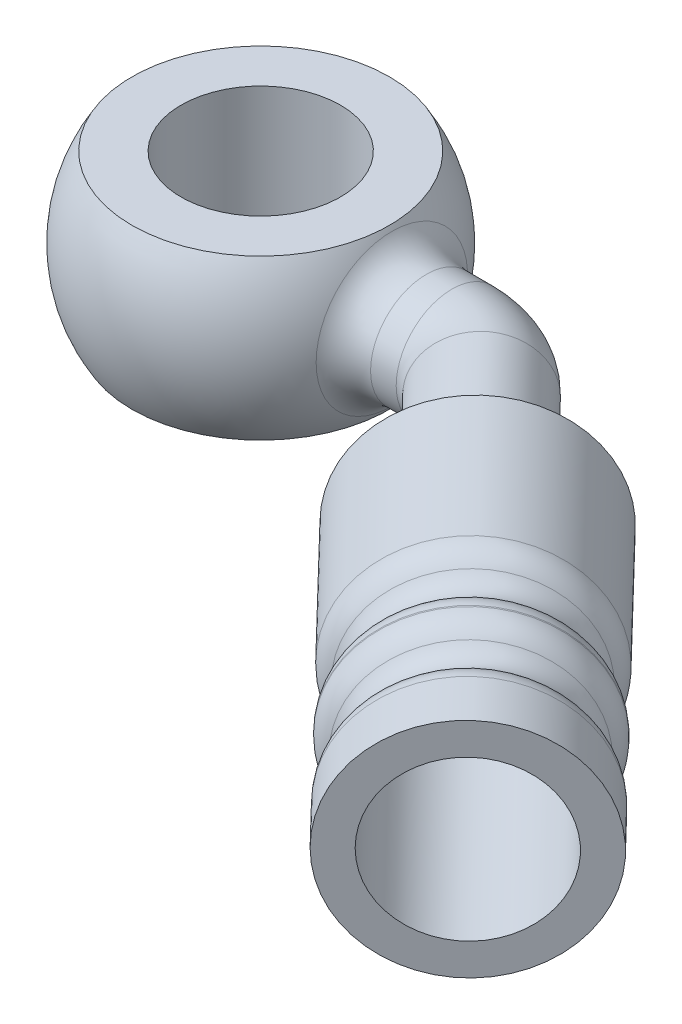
ISO-10303-21;
HEADER;
FILE_DESCRIPTION(('STEP AP214'),'2;1');
FILE_NAME('part.step','',(''),(''),'','','');
FILE_SCHEMA(('AUTOMOTIVE_DESIGN { 1 0 10303 214 1 1 1 1 }'));
ENDSEC;
DATA;
#1=APPLICATION_CONTEXT('core data for automotive mechanical design processes');
#2=APPLICATION_PROTOCOL_DEFINITION('international standard','automotive_design',2000,#1);
#3=PRODUCT_CONTEXT('',#1,'mechanical');
#4=PRODUCT('Part','Part','',(#3));
#5=PRODUCT_RELATED_PRODUCT_CATEGORY('part','',(#4));
#6=PRODUCT_DEFINITION_FORMATION('','',#4);
#7=PRODUCT_DEFINITION_CONTEXT('part definition',#1,'design');
#8=PRODUCT_DEFINITION('design','',#6,#7);
#9=PRODUCT_DEFINITION_SHAPE('','',#8);
#10=(LENGTH_UNIT() NAMED_UNIT(*) SI_UNIT(.MILLI.,.METRE.));
#11=(NAMED_UNIT(*) PLANE_ANGLE_UNIT() SI_UNIT($,.RADIAN.));
#12=(NAMED_UNIT(*) SI_UNIT($,.STERADIAN.) SOLID_ANGLE_UNIT());
#13=UNCERTAINTY_MEASURE_WITH_UNIT(LENGTH_MEASURE(1.E-05),#10,'distance_accuracy_value','');
#14=(GEOMETRIC_REPRESENTATION_CONTEXT(3) GLOBAL_UNCERTAINTY_ASSIGNED_CONTEXT((#13)) GLOBAL_UNIT_ASSIGNED_CONTEXT((#10,
#11,#12)) REPRESENTATION_CONTEXT('',''));
#15=CARTESIAN_POINT('',(0.,0.,0.));
#16=DIRECTION('',(0.,0.,1.));
#17=DIRECTION('',(1.,0.,0.));
#18=AXIS2_PLACEMENT_3D('',#15,#16,#17);
#19=CARTESIAN_POINT('',(15.2226232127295,0.,1.36792239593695));
#20=DIRECTION('',(0.694658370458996,0.,0.719339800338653));
#21=DIRECTION('',(0.719339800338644,0.,-0.694658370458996));
#22=AXIS2_PLACEMENT_3D('',#19,#20,#21);
#23=CYLINDRICAL_SURFACE('',#22,3.5);
#24=CARTESIAN_POINT('',(20.3287453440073,0.,6.65546664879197));
#25=DIRECTION('',(0.694658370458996,0.,0.719339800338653));
#26=DIRECTION('',(0.719339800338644,0.,-0.694658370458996));
#27=AXIS2_PLACEMENT_3D('',#24,#25,#26);
#28=CIRCLE('',#27,3.5);
#29=CARTESIAN_POINT('',(22.8464346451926,0.,4.22416235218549));
#30=VERTEX_POINT('',#29);
#31=EDGE_CURVE('E55',#30,#30,#28,.F.);
#32=ORIENTED_EDGE('',*,*,#31,.T.);
#33=EDGE_LOOP('',(#32));
#34=FACE_BOUND('',#33,.T.);
#35=CARTESIAN_POINT('',(15.2226232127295,0.,1.36792239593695));
#36=DIRECTION('',(0.694658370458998,0.,0.719339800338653));
#37=DIRECTION('',(0.719339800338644,0.,-0.694658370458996));
#38=AXIS2_PLACEMENT_3D('',#35,#36,#37);
#39=CIRCLE('',#38,3.5);
#40=CARTESIAN_POINT('',(17.7403125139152,0.,-1.06338190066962));
#41=VERTEX_POINT('',#40);
#42=EDGE_CURVE('E152',#41,#41,#39,.T.);
#43=ORIENTED_EDGE('',*,*,#42,.T.);
#44=EDGE_LOOP('',(#43));
#45=FACE_BOUND('',#44,.T.);
#46=ADVANCED_FACE('F20',(#34,#45),#23,.T.);
#47=CARTESIAN_POINT('',(1.07552855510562E-13,-50.0000000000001,6.36643515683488E-13));
#48=DIRECTION('',(0.,-1.00000000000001,0.));
#49=DIRECTION('',(0.,0.,-1.));
#50=AXIS2_PLACEMENT_3D('',#47,#48,#49);
#51=CYLINDRICAL_SURFACE('',#50,5.);
#52=CARTESIAN_POINT('',(0.,5.,1.09721259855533E-13));
#53=DIRECTION('',(0.,-1.00000000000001,0.));
#54=DIRECTION('',(0.,0.,-1.));
#55=AXIS2_PLACEMENT_3D('',#52,#53,#54);
#56=CIRCLE('',#55,5.);
#57=CARTESIAN_POINT('',(0.,4.99999999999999,-4.9999999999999));
#58=VERTEX_POINT('',#57);
#59=EDGE_CURVE('E146',#58,#58,#56,.T.);
#60=ORIENTED_EDGE('',*,*,#59,.F.);
#61=EDGE_LOOP('',(#60));
#62=FACE_BOUND('',#61,.T.);
#63=CARTESIAN_POINT('',(0.,-4.99999999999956,1.09287578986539E-13));
#64=DIRECTION('',(0.,-1.00000000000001,0.));
#65=DIRECTION('',(0.,0.,-1.));
#66=AXIS2_PLACEMENT_3D('',#63,#64,#65);
#67=CIRCLE('',#66,5.);
#68=CARTESIAN_POINT('',(0.,-4.99999999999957,-4.99999999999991));
#69=VERTEX_POINT('',#68);
#70=EDGE_CURVE('E138',#69,#69,#67,.T.);
#71=ORIENTED_EDGE('',*,*,#70,.T.);
#72=EDGE_LOOP('',(#71));
#73=FACE_BOUND('',#72,.T.);
#74=CARTESIAN_POINT('',(4.89897948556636,0.,1.00000000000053));
#75=CARTESIAN_POINT('',(4.89898059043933,-0.0555643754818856,0.999997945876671));
#76=CARTESIAN_POINT('',(4.89993508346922,-0.111154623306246,0.99535317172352));
#77=CARTESIAN_POINT('',(4.90364431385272,-0.220762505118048,0.976912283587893));
#78=CARTESIAN_POINT('',(4.90640049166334,-0.274778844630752,0.963108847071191));
#79=CARTESIAN_POINT('',(4.91338873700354,-0.379637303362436,0.926795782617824));
#80=CARTESIAN_POINT('',(4.91761933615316,-0.430482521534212,0.904294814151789));
#81=CARTESIAN_POINT('',(4.92707799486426,-0.527674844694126,0.851249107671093));
#82=CARTESIAN_POINT('',(4.93230599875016,-0.574022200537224,0.820704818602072));
#83=CARTESIAN_POINT('',(4.94325299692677,-0.661561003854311,0.751979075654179));
#84=CARTESIAN_POINT('',(4.94897737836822,-0.702679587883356,0.713705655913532));
#85=CARTESIAN_POINT('',(4.96022472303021,-0.777957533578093,0.630806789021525));
#86=CARTESIAN_POINT('',(4.96574767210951,-0.812116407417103,0.586180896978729));
#87=CARTESIAN_POINT('',(4.97602796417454,-0.872788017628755,0.491361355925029));
#88=CARTESIAN_POINT('',(4.98077821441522,-0.89923151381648,0.441122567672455));
#89=CARTESIAN_POINT('',(4.98891736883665,-0.94327493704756,0.3368041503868));
#90=CARTESIAN_POINT('',(4.99230640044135,-0.960875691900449,0.282724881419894));
#91=CARTESIAN_POINT('',(4.99730320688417,-0.986507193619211,0.173016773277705));
#92=CARTESIAN_POINT('',(4.99893386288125,-0.994660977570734,0.117417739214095));
#93=CARTESIAN_POINT('',(5.00030921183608,-1.00155095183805,0.00561856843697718));
#94=CARTESIAN_POINT('',(5.00005408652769,-1.00028804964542,-0.0505815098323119));
#95=CARTESIAN_POINT('',(4.99770434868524,-0.988473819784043,-0.161142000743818));
#96=CARTESIAN_POINT('',(4.99563598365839,-0.978055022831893,-0.215517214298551));
#97=CARTESIAN_POINT('',(4.98992177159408,-0.94843496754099,-0.32173162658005));
#98=CARTESIAN_POINT('',(4.98627586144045,-0.929233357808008,-0.373570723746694));
#99=CARTESIAN_POINT('',(4.97777296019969,-0.882469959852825,-0.473619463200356));
#100=CARTESIAN_POINT('',(4.97290848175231,-0.854856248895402,-0.52180417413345));
#101=CARTESIAN_POINT('',(4.96250469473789,-0.792090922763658,-0.612905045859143));
#102=CARTESIAN_POINT('',(4.95696530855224,-0.75693844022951,-0.655820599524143));
#103=CARTESIAN_POINT('',(4.9457096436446,-0.679366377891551,-0.735951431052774));
#104=CARTESIAN_POINT('',(4.93999196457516,-0.636830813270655,-0.773054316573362));
#105=CARTESIAN_POINT('',(4.92911571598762,-0.546083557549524,-0.839618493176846));
#106=CARTESIAN_POINT('',(4.92395715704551,-0.497871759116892,-0.869079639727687));
#107=CARTESIAN_POINT('',(4.91478047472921,-0.396979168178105,-0.919562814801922));
#108=CARTESIAN_POINT('',(4.91076481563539,-0.344289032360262,-0.940566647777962));
#109=CARTESIAN_POINT('',(4.90436476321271,-0.236028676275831,-0.973390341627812));
#110=CARTESIAN_POINT('',(4.90198015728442,-0.180458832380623,-0.985211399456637));
#111=CARTESIAN_POINT('',(4.8991547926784,-0.0690351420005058,-0.999166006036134));
#112=CARTESIAN_POINT('',(4.89868147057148,-0.013202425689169,-1.00146185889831));
#113=CARTESIAN_POINT('',(4.89964485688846,0.0980482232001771,-0.996737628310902));
#114=CARTESIAN_POINT('',(4.90108145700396,0.153466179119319,-0.989718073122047));
#115=CARTESIAN_POINT('',(4.90567232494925,0.261768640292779,-0.966702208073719));
#116=CARTESIAN_POINT('',(4.90880999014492,0.314672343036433,-0.95079262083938));
#117=CARTESIAN_POINT('',(4.9164348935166,0.417063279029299,-0.910541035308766));
#118=CARTESIAN_POINT('',(4.9209222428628,0.46655023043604,-0.886198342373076));
#119=CARTESIAN_POINT('',(4.93081405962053,0.561413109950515,-0.829404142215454));
#120=CARTESIAN_POINT('',(4.93622971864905,0.606727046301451,-0.796851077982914));
#121=CARTESIAN_POINT('',(4.94733723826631,0.691308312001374,-0.72469557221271));
#122=CARTESIAN_POINT('',(4.95302912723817,0.730575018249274,-0.685092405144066));
#123=CARTESIAN_POINT('',(4.96415345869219,0.802562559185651,-0.599232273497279));
#124=CARTESIAN_POINT('',(4.96958057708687,0.835173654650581,-0.552882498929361));
#125=CARTESIAN_POINT('',(4.97947127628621,0.892145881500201,-0.45526789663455));
#126=CARTESIAN_POINT('',(4.98393489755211,0.916507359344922,-0.404003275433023));
#127=CARTESIAN_POINT('',(4.99137294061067,0.956128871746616,-0.298302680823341));
#128=CARTESIAN_POINT('',(4.99435579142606,0.971440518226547,-0.243886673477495));
#129=CARTESIAN_POINT('',(4.99853235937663,0.992691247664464,-0.133189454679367));
#130=CARTESIAN_POINT('',(4.99972629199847,0.998631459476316,-0.0769084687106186));
#131=CARTESIAN_POINT('',(5.00018540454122,1.00092698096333,0.0348728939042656));
#132=CARTESIAN_POINT('',(4.9994837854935,0.997447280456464,0.0903698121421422));
#133=CARTESIAN_POINT('',(4.99630043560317,0.981366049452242,0.199971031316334));
#134=CARTESIAN_POINT('',(4.99381872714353,0.968764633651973,0.254075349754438));
#135=CARTESIAN_POINT('',(4.98735498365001,0.934871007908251,0.359252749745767));
#136=CARTESIAN_POINT('',(4.98337637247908,0.91359862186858,0.410332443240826));
#137=CARTESIAN_POINT('',(4.9743472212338,0.862987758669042,0.508221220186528));
#138=CARTESIAN_POINT('',(4.96929659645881,0.833648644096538,0.555029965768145));
#139=CARTESIAN_POINT('',(4.95857599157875,0.767180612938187,0.643863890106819));
#140=CARTESIAN_POINT('',(4.95289733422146,0.729933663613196,0.685799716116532));
#141=CARTESIAN_POINT('',(4.94161222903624,0.648949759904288,0.762882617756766));
#142=CARTESIAN_POINT('',(4.93600579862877,0.605211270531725,0.798028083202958));
#143=CARTESIAN_POINT('',(4.92543342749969,0.51192068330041,0.860892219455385));
#144=CARTESIAN_POINT('',(4.92047503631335,0.462311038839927,0.888526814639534));
#145=CARTESIAN_POINT('',(4.91185237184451,0.359067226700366,0.935024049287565));
#146=CARTESIAN_POINT('',(4.9081869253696,0.305436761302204,0.95389464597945));
#147=CARTESIAN_POINT('',(4.90329681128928,0.209737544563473,0.978669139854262));
#148=CARTESIAN_POINT('',(4.9016878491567,0.168214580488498,0.986653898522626));
#149=CARTESIAN_POINT('',(4.89952878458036,0.0844660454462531,0.997320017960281));
#150=CARTESIAN_POINT('',(4.89897864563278,0.042240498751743,1.00000156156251));
#151=CARTESIAN_POINT('',(4.89897948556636,0.,1.00000000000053));
#152=B_SPLINE_CURVE_WITH_KNOTS('',3,(#74,#75,#76,#77,#78,#79,#80,#81,#82,#83,#84,#85,#86,#87,
#88,#89,#90,#91,#92,#93,#94,#95,#96,#97,#98,#99,#100,#101,#102,#103,#104,#105,#106,#107,#108,
#109,#110,#111,#112,#113,#114,#115,#116,#117,#118,#119,#120,#121,#122,#123,#124,#125,#126,#127,
#128,#129,#130,#131,#132,#133,#134,#135,#136,#137,#138,#139,#140,#141,#142,#143,#144,#145,#146,
#147,#148,#149,#150,#151),.UNSPECIFIED.,.T.,.F.,(4,2,2,2,2,2,2,2,2,2,2,2,2,2,2,2,2,2,2,2,2,2,2,
2,2,2,2,2,2,2,2,2,2,2,2,2,2,2,4),(0.,0.166538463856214,0.333210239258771,0.499716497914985,
0.666213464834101,0.834822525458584,1.00344340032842,1.17353400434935,1.34360868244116,
1.51144248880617,1.67926012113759,1.84468789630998,2.0101222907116,2.17659924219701,
2.34309535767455,2.51249346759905,2.6818947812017,2.85165863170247,3.02140035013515,
3.18823757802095,3.35506534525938,3.52029341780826,3.6855351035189,3.85293059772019,
4.02034332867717,4.19032601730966,4.36030156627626,4.52929813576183,4.69827434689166,
4.8643101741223,5.03034391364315,5.19600017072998,5.36166952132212,5.53001152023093,
5.69839338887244,5.86858898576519,6.03862975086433,6.16523803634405,6.29184195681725),.UNSPECIFIED.);
#153=CARTESIAN_POINT('',(4.89897948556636,0.,1.00000000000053));
#154=VERTEX_POINT('',#153);
#155=EDGE_CURVE('E65',#154,#154,#152,.T.);
#156=ORIENTED_EDGE('',*,*,#155,.T.);
#157=EDGE_LOOP('',(#156));
#158=FACE_BOUND('',#157,.T.);
#159=ADVANCED_FACE('F22',(#62,#73,#158),#51,.F.);
#160=CARTESIAN_POINT('',(0.,4.02455846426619E-13,6.93889390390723E-13));
#161=DIRECTION('',(0.,-1.00000000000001,0.));
#162=DIRECTION('',(0.999999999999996,0.,0.));
#163=AXIS2_PLACEMENT_3D('',#160,#161,#162);
#164=SPHERICAL_SURFACE('',#163,9.5);
#165=CARTESIAN_POINT('',(8.22724133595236,0.,-8.31799906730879E-13));
#166=DIRECTION('',(-0.999999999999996,0.,0.));
#167=DIRECTION('',(0.,0.,1.));
#168=AXIS2_PLACEMENT_3D('',#165,#166,#167);
#169=CIRCLE('',#168,4.75);
#170=CARTESIAN_POINT('',(8.2272413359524,0.,4.74999999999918));
#171=VERTEX_POINT('',#170);
#172=EDGE_CURVE('E61',#171,#171,#169,.T.);
#173=ORIENTED_EDGE('',*,*,#172,.T.);
#174=EDGE_LOOP('',(#173));
#175=FACE_BOUND('',#174,.T.);
#176=CARTESIAN_POINT('',(0.,-4.99999999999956,1.09287578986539E-13));
#177=DIRECTION('',(0.,-1.00000000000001,0.));
#178=DIRECTION('',(0.,0.,-1.));
#179=AXIS2_PLACEMENT_3D('',#176,#177,#178);
#180=CIRCLE('',#179,8.07774721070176);
#181=CARTESIAN_POINT('',(0.,-4.99999999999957,-8.07774721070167));
#182=VERTEX_POINT('',#181);
#183=EDGE_CURVE('E135',#182,#182,#180,.T.);
#184=ORIENTED_EDGE('',*,*,#183,.F.);
#185=EDGE_LOOP('',(#184));
#186=FACE_BOUND('',#185,.T.);
#187=CARTESIAN_POINT('',(0.,5.,1.09721259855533E-13));
#188=DIRECTION('',(0.,-1.00000000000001,0.));
#189=DIRECTION('',(0.,0.,-1.));
#190=AXIS2_PLACEMENT_3D('',#187,#188,#189);
#191=CIRCLE('',#190,8.07774721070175);
#192=CARTESIAN_POINT('',(0.,4.99999999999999,-8.07774721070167));
#193=VERTEX_POINT('',#192);
#194=EDGE_CURVE('E141',#193,#193,#191,.T.);
#195=ORIENTED_EDGE('',*,*,#194,.T.);
#196=EDGE_LOOP('',(#195));
#197=FACE_BOUND('',#196,.T.);
#198=CARTESIAN_POINT('',(-8.36660026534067,0.,4.13297868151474E-13));
#199=DIRECTION('',(0.999999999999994,0.,0.));
#200=DIRECTION('',(0.,1.00000000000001,0.));
#201=AXIS2_PLACEMENT_3D('',#198,#199,#200);
#202=CIRCLE('',#201,4.5);
#203=CARTESIAN_POINT('',(-8.36660026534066,4.50000000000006,4.11642941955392E-13));
#204=VERTEX_POINT('',#203);
#205=EDGE_CURVE('E64',#204,#204,#202,.F.);
#206=ORIENTED_EDGE('',*,*,#205,.F.);
#207=EDGE_LOOP('',(#206));
#208=FACE_BOUND('',#207,.T.);
#209=ADVANCED_FACE('F105',(#175,#186,#197,#208),#164,.T.);
#210=CARTESIAN_POINT('',(5.00000000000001,-4.99999999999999,0.));
#211=DIRECTION('',(0.,-1.00000000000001,0.));
#212=DIRECTION('',(0.,0.,-1.));
#213=AXIS2_PLACEMENT_3D('',#210,#211,#212);
#214=PLANE('',#213);
#215=ORIENTED_EDGE('',*,*,#183,.T.);
#216=EDGE_LOOP('',(#215));
#217=FACE_BOUND('',#216,.T.);
#218=ORIENTED_EDGE('',*,*,#70,.F.);
#219=EDGE_LOOP('',(#218));
#220=FACE_BOUND('',#219,.T.);
#221=ADVANCED_FACE('F124',(#217,#220),#214,.T.);
#222=CARTESIAN_POINT('',(5.00000000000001,5.,1.95156391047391E-13));
#223=DIRECTION('',(0.,1.00000000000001,0.));
#224=DIRECTION('',(0.,0.,1.));
#225=AXIS2_PLACEMENT_3D('',#222,#223,#224);
#226=PLANE('',#225);
#227=ORIENTED_EDGE('',*,*,#59,.T.);
#228=EDGE_LOOP('',(#227));
#229=FACE_BOUND('',#228,.T.);
#230=ORIENTED_EDGE('',*,*,#194,.F.);
#231=EDGE_LOOP('',(#230));
#232=FACE_BOUND('',#231,.T.);
#233=ADVANCED_FACE('F120',(#229,#232),#226,.T.);
#234=CARTESIAN_POINT('',(-8.36660026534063,4.50000000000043,-9.50000000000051));
#235=DIRECTION('',(0.999999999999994,0.,0.));
#236=DIRECTION('',(0.,1.00000000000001,0.));
#237=AXIS2_PLACEMENT_3D('',#234,#235,#236);
#238=PLANE('',#237);
#239=ORIENTED_EDGE('',*,*,#205,.T.);
#240=EDGE_LOOP('',(#239));
#241=FACE_BOUND('',#240,.T.);
#242=ADVANCED_FACE('F117',(#241),#238,.F.);
#243=CARTESIAN_POINT('',(28.9081593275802,1.59594559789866E-13,15.5397099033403));
#244=DIRECTION('',(0.694658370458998,0.,0.719339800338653));
#245=DIRECTION('',(0.719339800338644,0.,-0.694658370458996));
#246=AXIS2_PLACEMENT_3D('',#243,#244,#245);
#247=PLANE('',#246);
#248=CARTESIAN_POINT('',(28.9081593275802,1.59594559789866E-13,15.5397099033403));
#249=DIRECTION('',(0.694658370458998,0.,0.719339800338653));
#250=DIRECTION('',(0.719339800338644,0.,-0.694658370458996));
#251=AXIS2_PLACEMENT_3D('',#248,#249,#250);
#252=CIRCLE('',#251,1.);
#253=CARTESIAN_POINT('',(29.6274991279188,1.57533708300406E-13,14.8450515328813));
#254=VERTEX_POINT('',#253);
#255=EDGE_CURVE('E72',#254,#254,#252,.T.);
#256=ORIENTED_EDGE('',*,*,#255,.F.);
#257=EDGE_LOOP('',(#256));
#258=FACE_BOUND('',#257,.T.);
#259=CARTESIAN_POINT('',(28.9081593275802,1.59594559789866E-13,15.5397099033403));
#260=DIRECTION('',(-0.694658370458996,0.,-0.719339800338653));
#261=DIRECTION('',(-0.719339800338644,0.,0.694658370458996));
#262=AXIS2_PLACEMENT_3D('',#259,#260,#261);
#263=CIRCLE('',#262,4.99999999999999);
#264=CARTESIAN_POINT('',(25.311460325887,1.69309011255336E-13,19.0130017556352));
#265=VERTEX_POINT('',#264);
#266=EDGE_CURVE('E73',#265,#265,#263,.T.);
#267=ORIENTED_EDGE('',*,*,#266,.F.);
#268=EDGE_LOOP('',(#267));
#269=FACE_BOUND('',#268,.T.);
#270=ADVANCED_FACE('F109',(#258,#269),#247,.T.);
#271=CARTESIAN_POINT('',(12.,0.,4.47997345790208));
#272=DIRECTION('',(0.,1.00000000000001,0.));
#273=DIRECTION('',(0.,0.,1.));
#274=AXIS2_PLACEMENT_3D('',#271,#272,#273);
#275=TOROIDAL_SURFACE('',#274,4.47997345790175,3.5);
#276=CARTESIAN_POINT('',(12.0000000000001,2.84494650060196E-13,-2.75821032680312E-13));
#277=DIRECTION('',(0.999999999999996,0.,0.));
#278=DIRECTION('',(0.,0.,-1.));
#279=AXIS2_PLACEMENT_3D('',#276,#277,#278);
#280=CIRCLE('',#279,3.5);
#281=CARTESIAN_POINT('',(12.0000000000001,4.52546982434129E-13,-3.49999999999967));
#282=VERTEX_POINT('',#281);
#283=EDGE_CURVE('E149',#282,#282,#280,.T.);
#284=CARTESIAN_POINT('',(12.,0.,4.47997345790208));
#285=DIRECTION('',(0.,1.00000000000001,0.));
#286=DIRECTION('',(0.,0.,1.));
#287=AXIS2_PLACEMENT_3D('',#284,#285,#286);
#288=CIRCLE('',#287,7.97997345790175);
#289=EDGE_CURVE('',#41,#282,#288,.T.);
#290=ORIENTED_EDGE('',*,*,#42,.F.);
#291=ORIENTED_EDGE('',*,*,#283,.T.);
#292=ORIENTED_EDGE('',*,*,#289,.T.);
#293=ORIENTED_EDGE('',*,*,#289,.F.);
#294=EDGE_LOOP('',(#290,#292,#291,#293));
#295=FACE_BOUND('',#294,.T.);
#296=ADVANCED_FACE('F110',(#295),#275,.T.);
#297=CARTESIAN_POINT('',(12.0000000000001,2.84494650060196E-13,-2.75821032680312E-13));
#298=DIRECTION('',(-0.999999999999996,0.,0.));
#299=DIRECTION('',(0.,0.,1.));
#300=AXIS2_PLACEMENT_3D('',#297,#298,#299);
#301=CYLINDRICAL_SURFACE('',#300,3.5);
#302=CARTESIAN_POINT('',(10.3923048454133,4.37150315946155E-13,7.23379689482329E-13));
#303=DIRECTION('',(-0.999999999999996,0.,0.));
#304=DIRECTION('',(0.,0.,1.));
#305=AXIS2_PLACEMENT_3D('',#302,#303,#304);
#306=CIRCLE('',#305,3.5);
#307=CARTESIAN_POINT('',(10.3923048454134,4.41546105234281E-13,3.50000000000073));
#308=VERTEX_POINT('',#307);
#309=EDGE_CURVE('E58',#308,#308,#306,.F.);
#310=ORIENTED_EDGE('',*,*,#309,.T.);
#311=EDGE_LOOP('',(#310));
#312=FACE_BOUND('',#311,.T.);
#313=ORIENTED_EDGE('',*,*,#283,.F.);
#314=EDGE_LOOP('',(#313));
#315=FACE_BOUND('',#314,.T.);
#316=ADVANCED_FACE('F93',(#312,#315),#301,.T.);
#317=CARTESIAN_POINT('',(12.0000000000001,2.84494650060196E-13,-2.75821032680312E-13));
#318=DIRECTION('',(-0.999999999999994,0.,0.));
#319=DIRECTION('',(0.,0.,1.));
#320=AXIS2_PLACEMENT_3D('',#317,#318,#319);
#321=CYLINDRICAL_SURFACE('',#320,1.);
#322=ORIENTED_EDGE('',*,*,#155,.F.);
#323=EDGE_LOOP('',(#322));
#324=FACE_BOUND('',#323,.T.);
#325=CARTESIAN_POINT('',(12.0000000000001,2.84494650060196E-13,-2.75821032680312E-13));
#326=DIRECTION('',(0.999999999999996,0.,0.));
#327=DIRECTION('',(0.,0.,-1.));
#328=AXIS2_PLACEMENT_3D('',#325,#326,#327);
#329=CIRCLE('',#328,1.);
#330=CARTESIAN_POINT('',(12.0000000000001,3.32509602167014E-13,-0.999999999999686));
#331=VERTEX_POINT('',#330);
#332=EDGE_CURVE('E155',#331,#331,#329,.T.);
#333=ORIENTED_EDGE('',*,*,#332,.T.);
#334=EDGE_LOOP('',(#333));
#335=FACE_BOUND('',#334,.T.);
#336=ADVANCED_FACE('F75',(#324,#335),#321,.F.);
#337=CARTESIAN_POINT('',(12.,0.,4.47997345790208));
#338=DIRECTION('',(0.,1.00000000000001,0.));
#339=DIRECTION('',(0.,0.,1.));
#340=AXIS2_PLACEMENT_3D('',#337,#338,#339);
#341=TOROIDAL_SURFACE('',#340,4.47997345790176,1.);
#342=CARTESIAN_POINT('',(15.2226232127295,0.,1.367922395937));
#343=DIRECTION('',(0.694658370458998,0.,0.719339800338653));
#344=DIRECTION('',(0.719339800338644,0.,-0.694658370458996));
#345=AXIS2_PLACEMENT_3D('',#342,#343,#344);
#346=CIRCLE('',#345,1.);
#347=CARTESIAN_POINT('',(15.9419630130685,0.,0.673264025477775));
#348=VERTEX_POINT('',#347);
#349=EDGE_CURVE('E158',#348,#348,#346,.T.);
#350=CARTESIAN_POINT('',(12.,0.,4.47997345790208));
#351=DIRECTION('',(0.,1.00000000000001,0.));
#352=DIRECTION('',(0.,0.,1.));
#353=AXIS2_PLACEMENT_3D('',#350,#351,#352);
#354=CIRCLE('',#353,5.47997345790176);
#355=EDGE_CURVE('',#348,#331,#354,.T.);
#356=ORIENTED_EDGE('',*,*,#349,.T.);
#357=ORIENTED_EDGE('',*,*,#332,.F.);
#358=ORIENTED_EDGE('',*,*,#355,.T.);
#359=ORIENTED_EDGE('',*,*,#355,.F.);
#360=EDGE_LOOP('',(#356,#358,#357,#359));
#361=FACE_BOUND('',#360,.T.);
#362=ADVANCED_FACE('F86',(#361),#341,.F.);
#363=CARTESIAN_POINT('',(15.2226232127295,0.,1.367922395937));
#364=DIRECTION('',(0.694658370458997,0.,0.719339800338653));
#365=DIRECTION('',(0.719339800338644,0.,-0.694658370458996));
#366=AXIS2_PLACEMENT_3D('',#363,#364,#365);
#367=CYLINDRICAL_SURFACE('',#366,1.);
#368=ORIENTED_EDGE('',*,*,#349,.F.);
#369=EDGE_LOOP('',(#368));
#370=FACE_BOUND('',#369,.T.);
#371=ORIENTED_EDGE('',*,*,#255,.T.);
#372=EDGE_LOOP('',(#371));
#373=FACE_BOUND('',#372,.T.);
#374=ADVANCED_FACE('F84',(#370,#373),#367,.F.);
#375=CARTESIAN_POINT('',(10.3923048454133,4.37150315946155E-13,7.23379689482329E-13));
#376=DIRECTION('',(-0.999999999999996,0.,0.));
#377=DIRECTION('',(0.,0.,1.));
#378=AXIS2_PLACEMENT_3D('',#375,#376,#377);
#379=TOROIDAL_SURFACE('',#378,6.,2.5);
#380=ORIENTED_EDGE('',*,*,#309,.F.);
#381=EDGE_LOOP('',(#380));
#382=FACE_BOUND('',#381,.T.);
#383=ORIENTED_EDGE('',*,*,#172,.F.);
#384=EDGE_LOOP('',(#383));
#385=FACE_BOUND('',#384,.T.);
#386=ADVANCED_FACE('F82',(#382,#385),#379,.F.);
#387=CARTESIAN_POINT('',(28.9081593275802,1.59594559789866E-13,15.5397099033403));
#388=DIRECTION('',(-0.694658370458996,0.,-0.719339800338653));
#389=DIRECTION('',(-0.719339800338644,0.,0.694658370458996));
#390=AXIS2_PLACEMENT_3D('',#387,#388,#389);
#391=CYLINDRICAL_SURFACE('',#390,4.99999999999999);
#392=CARTESIAN_POINT('',(39.4318505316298,3.05311331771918E-13,26.4373111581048));
#393=DIRECTION('',(-0.694658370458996,0.,-0.719339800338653));
#394=DIRECTION('',(-0.719339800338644,0.,0.694658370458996));
#395=AXIS2_PLACEMENT_3D('',#392,#393,#394);
#396=CIRCLE('',#395,4.99999999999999);
#397=CARTESIAN_POINT('',(35.8351515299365,1.74722712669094E-13,29.9106030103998));
#398=VERTEX_POINT('',#397);
#399=EDGE_CURVE('E164',#398,#398,#396,.T.);
#400=CARTESIAN_POINT('',(35.8351515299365,1.74722712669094E-13,29.9106030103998));
#401=CARTESIAN_POINT('',(35.725529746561,1.74666319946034E-13,29.7970863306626));
#402=CARTESIAN_POINT('',(35.6159079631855,1.74609927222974E-13,29.6835696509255));
#403=CARTESIAN_POINT('',(35.3966643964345,1.74497141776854E-13,29.4565362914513));
#404=CARTESIAN_POINT('',(35.2870426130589,1.74440749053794E-13,29.3430196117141));
#405=CARTESIAN_POINT('',(35.0677990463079,1.74327963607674E-13,29.1159862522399));
#406=CARTESIAN_POINT('',(34.9581772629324,1.74271570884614E-13,29.0024695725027));
#407=CARTESIAN_POINT('',(34.7389336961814,1.74158785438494E-13,28.7754362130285));
#408=CARTESIAN_POINT('',(34.6293119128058,1.74102392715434E-13,28.6619195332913));
#409=CARTESIAN_POINT('',(34.4100683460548,1.73989607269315E-13,28.4348861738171));
#410=CARTESIAN_POINT('',(34.3004465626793,1.73933214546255E-13,28.3213694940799));
#411=CARTESIAN_POINT('',(34.0812029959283,1.73820429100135E-13,28.0943361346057));
#412=CARTESIAN_POINT('',(33.9715812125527,1.73764036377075E-13,27.9808194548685));
#413=CARTESIAN_POINT('',(33.7523376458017,1.73651250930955E-13,27.7537860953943));
#414=CARTESIAN_POINT('',(33.6427158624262,1.73594858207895E-13,27.6402694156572));
#415=CARTESIAN_POINT('',(33.4234722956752,1.73482072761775E-13,27.4132360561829));
#416=CARTESIAN_POINT('',(33.3138505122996,1.73425680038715E-13,27.2997193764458));
#417=CARTESIAN_POINT('',(33.0946069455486,1.73312894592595E-13,27.0726860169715));
#418=CARTESIAN_POINT('',(32.9849851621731,1.73256501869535E-13,26.9591693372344));
#419=CARTESIAN_POINT('',(32.7657415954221,1.73143716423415E-13,26.7321359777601));
#420=CARTESIAN_POINT('',(32.6561198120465,1.73087323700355E-13,26.618619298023));
#421=CARTESIAN_POINT('',(32.4368762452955,1.72974538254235E-13,26.3915859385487));
#422=CARTESIAN_POINT('',(32.32725446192,1.72918145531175E-13,26.2780692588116));
#423=CARTESIAN_POINT('',(32.108010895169,1.72805360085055E-13,26.0510358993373));
#424=CARTESIAN_POINT('',(31.9983891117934,1.72748967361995E-13,25.9375192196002));
#425=CARTESIAN_POINT('',(31.7791455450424,1.72636181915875E-13,25.7104858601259));
#426=CARTESIAN_POINT('',(31.6695237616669,1.72579789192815E-13,25.5969691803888));
#427=CARTESIAN_POINT('',(31.4502801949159,1.72467003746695E-13,25.3699358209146));
#428=CARTESIAN_POINT('',(31.3406584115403,1.72410611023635E-13,25.2564191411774));
#429=CARTESIAN_POINT('',(31.1214148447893,1.72297825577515E-13,25.0293857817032));
#430=CARTESIAN_POINT('',(31.0117930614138,1.72241432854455E-13,24.915869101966));
#431=CARTESIAN_POINT('',(30.7925494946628,1.72128647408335E-13,24.6888357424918));
#432=CARTESIAN_POINT('',(30.6829277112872,1.72072254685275E-13,24.5753190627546));
#433=CARTESIAN_POINT('',(30.4636841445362,1.71959469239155E-13,24.3482857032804));
#434=CARTESIAN_POINT('',(30.3540623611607,1.71903076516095E-13,24.2347690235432));
#435=CARTESIAN_POINT('',(30.1348187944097,1.71790291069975E-13,24.007735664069));
#436=CARTESIAN_POINT('',(30.0251970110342,1.71733898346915E-13,23.8942189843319));
#437=CARTESIAN_POINT('',(29.8059534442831,1.71621112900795E-13,23.6671856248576));
#438=CARTESIAN_POINT('',(29.6963316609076,1.71564720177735E-13,23.5536689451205));
#439=CARTESIAN_POINT('',(29.4770880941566,1.71451934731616E-13,23.3266355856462));
#440=CARTESIAN_POINT('',(29.3674663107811,1.71395542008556E-13,23.2131189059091));
#441=CARTESIAN_POINT('',(29.14822274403,1.71282756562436E-13,22.9860855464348));
#442=CARTESIAN_POINT('',(29.0386009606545,1.71226363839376E-13,22.8725688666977));
#443=CARTESIAN_POINT('',(28.8193573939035,1.71113578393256E-13,22.6455355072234));
#444=CARTESIAN_POINT('',(28.709735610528,1.71057185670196E-13,22.5320188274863));
#445=CARTESIAN_POINT('',(28.4904920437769,1.70944400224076E-13,22.304985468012));
#446=CARTESIAN_POINT('',(28.3808702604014,1.70888007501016E-13,22.1914687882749));
#447=CARTESIAN_POINT('',(28.1616266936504,1.70775222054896E-13,21.9644354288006));
#448=CARTESIAN_POINT('',(28.0520049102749,1.70718829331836E-13,21.8509187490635));
#449=CARTESIAN_POINT('',(27.8327613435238,1.70606043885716E-13,21.6238853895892));
#450=CARTESIAN_POINT('',(27.7231395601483,1.70549651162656E-13,21.5103687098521));
#451=CARTESIAN_POINT('',(27.5038959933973,1.70436865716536E-13,21.2833353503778));
#452=CARTESIAN_POINT('',(27.3942742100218,1.70380472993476E-13,21.1698186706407));
#453=CARTESIAN_POINT('',(27.1750306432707,1.70267687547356E-13,20.9427853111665));
#454=CARTESIAN_POINT('',(27.0654088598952,1.70211294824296E-13,20.8292686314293));
#455=CARTESIAN_POINT('',(26.8461652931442,1.70098509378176E-13,20.6022352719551));
#456=CARTESIAN_POINT('',(26.7365435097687,1.70042116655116E-13,20.4887185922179));
#457=CARTESIAN_POINT('',(26.5172999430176,1.69929331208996E-13,20.2616852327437));
#458=CARTESIAN_POINT('',(26.4076781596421,1.69872938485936E-13,20.1481685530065));
#459=CARTESIAN_POINT('',(26.1884345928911,1.69760153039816E-13,19.9211351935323));
#460=CARTESIAN_POINT('',(26.0788128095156,1.69703760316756E-13,19.8076185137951));
#461=CARTESIAN_POINT('',(25.8595692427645,1.69590974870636E-13,19.5805851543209));
#462=CARTESIAN_POINT('',(25.749947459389,1.69534582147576E-13,19.4670684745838));
#463=CARTESIAN_POINT('',(25.530703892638,1.69421796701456E-13,19.2400351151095));
#464=CARTESIAN_POINT('',(25.4210821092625,1.69365403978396E-13,19.1265184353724));
#465=CARTESIAN_POINT('',(25.311460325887,1.69309011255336E-13,19.0130017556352));
#466=B_SPLINE_CURVE_WITH_KNOTS('',3,(#400,#401,#402,#403,#404,#405,#406,#407,#408,#409,#410,
#411,#412,#413,#414,#415,#416,#417,#418,#419,#420,#421,#422,#423,#424,#425,#426,#427,#428,#429,
#430,#431,#432,#433,#434,#435,#436,#437,#438,#439,#440,#441,#442,#443,#444,#445,#446,#447,#448,
#449,#450,#451,#452,#453,#454,#455,#456,#457,#458,#459,#460,#461,#462,#463,#464,#465),
.UNSPECIFIED.,.F.,.F.,(4,2,2,2,2,2,2,2,2,2,2,2,2,2,2,2,2,2,2,2,2,2,2,2,2,2,2,2,2,2,2,2,4),(0.,
0.473420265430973,0.946840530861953,1.42026079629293,1.89368106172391,2.36710132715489,
2.84052159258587,3.31394185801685,3.78736212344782,4.2607823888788,4.73420265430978,
5.20762291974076,5.68104318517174,6.15446345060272,6.62788371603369,7.10130398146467,
7.57472424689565,8.04814451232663,8.52156477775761,8.99498504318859,9.46840530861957,
9.94182557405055,10.4152458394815,10.8886661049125,11.3620863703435,11.8355066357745,
12.3089269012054,12.7823471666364,13.2557674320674,13.7291876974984,14.2026079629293,
14.6760282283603,15.1494484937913),.UNSPECIFIED.);
#467=EDGE_CURVE('BSEAM204',#398,#265,#466,.T.);
#468=ORIENTED_EDGE('',*,*,#399,.F.);
#469=ORIENTED_EDGE('',*,*,#266,.T.);
#470=ORIENTED_EDGE('',*,*,#467,.T.);
#471=ORIENTED_EDGE('',*,*,#467,.F.);
#472=EDGE_LOOP('',(#468,#470,#469,#471));
#473=FACE_BOUND('',#472,.T.);
#474=ADVANCED_FACE('F204',(#473),#391,.F.);
#475=CARTESIAN_POINT('',(44.4672291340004,5.55111512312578E-13,21.5747025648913));
#476=DIRECTION('',(-0.694658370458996,0.,-0.719339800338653));
#477=DIRECTION('',(-0.719339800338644,0.,0.694658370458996));
#478=AXIS2_PLACEMENT_3D('',#475,#476,#477);
#479=PLANE('',#478);
#480=CARTESIAN_POINT('',(39.4318505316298,3.05311331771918E-13,26.4373111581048));
#481=DIRECTION('',(-0.694658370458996,0.,-0.719339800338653));
#482=DIRECTION('',(-0.719339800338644,0.,0.694658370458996));
#483=AXIS2_PLACEMENT_3D('',#480,#481,#482);
#484=CIRCLE('',#483,7.00000000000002);
#485=CARTESIAN_POINT('',(34.3964719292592,1.78608493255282E-13,31.2999197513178));
#486=VERTEX_POINT('',#485);
#487=EDGE_CURVE('E167',#486,#486,#484,.T.);
#488=ORIENTED_EDGE('',*,*,#487,.F.);
#489=EDGE_LOOP('',(#488));
#490=FACE_BOUND('',#489,.T.);
#491=ORIENTED_EDGE('',*,*,#399,.T.);
#492=EDGE_LOOP('',(#491));
#493=FACE_BOUND('',#492,.T.);
#494=ADVANCED_FACE('F202',(#490,#493),#479,.F.);
#495=CARTESIAN_POINT('',(28.9081593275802,1.59594559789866E-13,15.5397099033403));
#496=DIRECTION('',(-0.694658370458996,0.,-0.719339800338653));
#497=DIRECTION('',(-0.719339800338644,0.,0.694658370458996));
#498=AXIS2_PLACEMENT_3D('',#495,#496,#497);
#499=CYLINDRICAL_SURFACE('',#498,7.00000000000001);
#500=CARTESIAN_POINT('',(37.0825236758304,3.88578058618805E-13,24.0045119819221));
#501=DIRECTION('',(0.694658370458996,0.,0.719339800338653));
#502=DIRECTION('',(0.719339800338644,0.,-0.694658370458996));
#503=AXIS2_PLACEMENT_3D('',#500,#501,#502);
#504=CIRCLE('',#503,7.00000000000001);
#505=CARTESIAN_POINT('',(32.0471450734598,1.7739992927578E-13,28.8671205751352));
#506=VERTEX_POINT('',#505);
#507=EDGE_CURVE('E10',#506,#506,#504,.T.);
#508=CARTESIAN_POINT('',(32.0471450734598,1.7739992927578E-13,28.8671205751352));
#509=CARTESIAN_POINT('',(32.0716172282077,1.774125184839E-13,28.8924622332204));
#510=CARTESIAN_POINT('',(32.0960893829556,1.7742510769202E-13,28.9178038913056));
#511=CARTESIAN_POINT('',(32.1450336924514,1.77450286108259E-13,28.9684872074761));
#512=CARTESIAN_POINT('',(32.1695058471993,1.77462875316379E-13,28.9938288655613));
#513=CARTESIAN_POINT('',(32.2184501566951,1.77488053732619E-13,29.0445121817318));
#514=CARTESIAN_POINT('',(32.242922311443,1.77500642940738E-13,29.069853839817));
#515=CARTESIAN_POINT('',(32.2918666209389,1.77525821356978E-13,29.1205371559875));
#516=CARTESIAN_POINT('',(32.3163387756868,1.77538410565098E-13,29.1458788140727));
#517=CARTESIAN_POINT('',(32.3652830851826,1.77563588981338E-13,29.1965621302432));
#518=CARTESIAN_POINT('',(32.3897552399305,1.77576178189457E-13,29.2219037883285));
#519=CARTESIAN_POINT('',(32.4386995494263,1.77601356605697E-13,29.2725871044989));
#520=CARTESIAN_POINT('',(32.4631717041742,1.77613945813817E-13,29.2979287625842));
#521=CARTESIAN_POINT('',(32.5121160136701,1.77639124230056E-13,29.3486120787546));
#522=CARTESIAN_POINT('',(32.536588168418,1.77651713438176E-13,29.3739537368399));
#523=CARTESIAN_POINT('',(32.5855324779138,1.77676891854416E-13,29.4246370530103));
#524=CARTESIAN_POINT('',(32.6100046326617,1.77689481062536E-13,29.4499787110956));
#525=CARTESIAN_POINT('',(32.6589489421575,1.77714659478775E-13,29.500662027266));
#526=CARTESIAN_POINT('',(32.6834210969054,1.77727248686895E-13,29.5260036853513));
#527=CARTESIAN_POINT('',(32.7323654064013,1.77752427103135E-13,29.5766870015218));
#528=CARTESIAN_POINT('',(32.7568375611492,1.77765016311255E-13,29.602028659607));
#529=CARTESIAN_POINT('',(32.805781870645,1.77790194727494E-13,29.6527119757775));
#530=CARTESIAN_POINT('',(32.8302540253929,1.77802783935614E-13,29.6780536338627));
#531=CARTESIAN_POINT('',(32.8791983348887,1.77827962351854E-13,29.7287369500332));
#532=CARTESIAN_POINT('',(32.9036704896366,1.77840551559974E-13,29.7540786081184));
#533=CARTESIAN_POINT('',(32.9526147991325,1.77865729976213E-13,29.8047619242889));
#534=CARTESIAN_POINT('',(32.9770869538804,1.77878319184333E-13,29.8301035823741));
#535=CARTESIAN_POINT('',(33.0260312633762,1.77903497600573E-13,29.8807868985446));
#536=CARTESIAN_POINT('',(33.0505034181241,1.77916086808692E-13,29.9061285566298));
#537=CARTESIAN_POINT('',(33.0994477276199,1.77941265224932E-13,29.9568118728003));
#538=CARTESIAN_POINT('',(33.1239198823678,1.77953854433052E-13,29.9821535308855));
#539=CARTESIAN_POINT('',(33.1728641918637,1.77979032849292E-13,30.032836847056));
#540=CARTESIAN_POINT('',(33.1973363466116,1.77991622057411E-13,30.0581785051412));
#541=CARTESIAN_POINT('',(33.2462806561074,1.78016800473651E-13,30.1088618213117));
#542=CARTESIAN_POINT('',(33.2707528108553,1.78029389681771E-13,30.1342034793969));
#543=CARTESIAN_POINT('',(33.3196971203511,1.7805456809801E-13,30.1848867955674));
#544=CARTESIAN_POINT('',(33.344169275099,1.7806715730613E-13,30.2102284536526));
#545=CARTESIAN_POINT('',(33.3931135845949,1.7809233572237E-13,30.2609117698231));
#546=CARTESIAN_POINT('',(33.4175857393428,1.7810492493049E-13,30.2862534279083));
#547=CARTESIAN_POINT('',(33.4665300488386,1.78130103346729E-13,30.3369367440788));
#548=CARTESIAN_POINT('',(33.4910022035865,1.78142692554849E-13,30.3622784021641));
#549=CARTESIAN_POINT('',(33.5399465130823,1.78167870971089E-13,30.4129617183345));
#550=CARTESIAN_POINT('',(33.5644186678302,1.78180460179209E-13,30.4383033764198));
#551=CARTESIAN_POINT('',(33.6133629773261,1.78205638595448E-13,30.4889866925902));
#552=CARTESIAN_POINT('',(33.637835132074,1.78218227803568E-13,30.5143283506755));
#553=CARTESIAN_POINT('',(33.6867794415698,1.78243406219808E-13,30.5650116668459));
#554=CARTESIAN_POINT('',(33.7112515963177,1.78255995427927E-13,30.5903533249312));
#555=CARTESIAN_POINT('',(33.7601959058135,1.78281173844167E-13,30.6410366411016));
#556=CARTESIAN_POINT('',(33.7846680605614,1.78293763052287E-13,30.6663782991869));
#557=CARTESIAN_POINT('',(33.8336123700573,1.78318941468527E-13,30.7170616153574));
#558=CARTESIAN_POINT('',(33.8580845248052,1.78331530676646E-13,30.7424032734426));
#559=CARTESIAN_POINT('',(33.907028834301,1.78356709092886E-13,30.7930865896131));
#560=CARTESIAN_POINT('',(33.9315009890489,1.78369298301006E-13,30.8184282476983));
#561=CARTESIAN_POINT('',(33.9804452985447,1.78394476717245E-13,30.8691115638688));
#562=CARTESIAN_POINT('',(34.0049174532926,1.78407065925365E-13,30.894453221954));
#563=CARTESIAN_POINT('',(34.0538617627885,1.78432244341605E-13,30.9451365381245));
#564=CARTESIAN_POINT('',(34.0783339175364,1.78444833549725E-13,30.9704781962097));
#565=CARTESIAN_POINT('',(34.1272782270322,1.78470011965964E-13,31.0211615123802));
#566=CARTESIAN_POINT('',(34.1517503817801,1.78482601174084E-13,31.0465031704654));
#567=CARTESIAN_POINT('',(34.2006946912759,1.78507779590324E-13,31.0971864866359));
#568=CARTESIAN_POINT('',(34.2251668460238,1.78520368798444E-13,31.1225281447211));
#569=CARTESIAN_POINT('',(34.2741111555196,1.78545547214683E-13,31.1732114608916));
#570=CARTESIAN_POINT('',(34.2985833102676,1.78558136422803E-13,31.1985531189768));
#571=CARTESIAN_POINT('',(34.3475276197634,1.78583314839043E-13,31.2492364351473));
#572=CARTESIAN_POINT('',(34.3719997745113,1.78595904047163E-13,31.2745780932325));
#573=CARTESIAN_POINT('',(34.3964719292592,1.78608493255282E-13,31.2999197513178));
#574=B_SPLINE_CURVE_WITH_KNOTS('',3,(#508,#509,#510,#511,#512,#513,#514,#515,#516,#517,#518,
#519,#520,#521,#522,#523,#524,#525,#526,#527,#528,#529,#530,#531,#532,#533,#534,#535,#536,#537,
#538,#539,#540,#541,#542,#543,#544,#545,#546,#547,#548,#549,#550,#551,#552,#553,#554,#555,#556,
#557,#558,#559,#560,#561,#562,#563,#564,#565,#566,#567,#568,#569,#570,#571,#572,#573),
.UNSPECIFIED.,.F.,.F.,(4,2,2,2,2,2,2,2,2,2,2,2,2,2,2,2,2,2,2,2,2,2,2,2,2,2,2,2,2,2,2,2,4),(0.,
0.105687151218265,0.211374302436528,0.317061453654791,0.422748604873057,0.528435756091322,
0.634122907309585,0.739810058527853,0.845497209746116,0.951184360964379,1.05687151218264,
1.16255866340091,1.26824581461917,1.37393296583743,1.4796201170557,1.58530726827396,
1.69099441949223,1.79668157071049,1.90236872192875,2.00805587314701,2.11374302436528,
2.21943017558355,2.32511732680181,2.43080447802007,2.53649162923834,2.6421787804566,
2.74786593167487,2.85355308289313,2.9592402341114,3.06492738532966,3.17061453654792,
3.27630168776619,3.38198883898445),.UNSPECIFIED.);
#575=EDGE_CURVE('BSEAM199',#506,#486,#574,.T.);
#576=ORIENTED_EDGE('',*,*,#507,.T.);
#577=ORIENTED_EDGE('',*,*,#487,.T.);
#578=ORIENTED_EDGE('',*,*,#575,.T.);
#579=ORIENTED_EDGE('',*,*,#575,.F.);
#580=EDGE_LOOP('',(#576,#578,#577,#579));
#581=FACE_BOUND('',#580,.T.);
#582=ADVANCED_FACE('F199',(#581),#499,.T.);
#583=CARTESIAN_POINT('',(35.2201783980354,1.87350135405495E-13,22.0759969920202));
#584=DIRECTION('',(-0.694658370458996,0.,-0.719339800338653));
#585=DIRECTION('',(-0.719339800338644,0.,0.694658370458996));
#586=AXIS2_PLACEMENT_3D('',#583,#584,#585);
#587=TOROIDAL_SURFACE('',#586,7.25,1.5);
#588=CARTESIAN_POINT('',(36.0183263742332,3.95516952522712E-13,22.9025034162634));
#589=DIRECTION('',(-0.694658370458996,0.,-0.719339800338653));
#590=DIRECTION('',(-0.719339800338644,0.,0.694658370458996));
#591=AXIS2_PLACEMENT_3D('',#588,#589,#590);
#592=CIRCLE('',#591,6.28571428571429);
#593=CARTESIAN_POINT('',(31.4967619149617,4.07729405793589E-13,27.2689274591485));
#594=VERTEX_POINT('',#593);
#595=EDGE_CURVE('E27',#594,#594,#592,.T.);
#596=ORIENTED_EDGE('',*,*,#595,.T.);
#597=EDGE_LOOP('',(#596));
#598=FACE_BOUND('',#597,.T.);
#599=CARTESIAN_POINT('',(34.4220304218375,1.52655665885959E-13,21.2494905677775));
#600=DIRECTION('',(0.694658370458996,0.,0.719339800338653));
#601=DIRECTION('',(0.719339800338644,0.,-0.694658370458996));
#602=AXIS2_PLACEMENT_3D('',#599,#600,#601);
#603=CIRCLE('',#602,6.2857142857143);
#604=CARTESIAN_POINT('',(38.943594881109,1.40443212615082E-13,16.8830665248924));
#605=VERTEX_POINT('',#604);
#606=EDGE_CURVE('E31',#605,#605,#603,.T.);
#607=ORIENTED_EDGE('',*,*,#606,.T.);
#608=EDGE_LOOP('',(#607));
#609=FACE_BOUND('',#608,.T.);
#610=ADVANCED_FACE('F195',(#598,#609),#587,.F.);
#611=CARTESIAN_POINT('',(28.9081593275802,1.59594559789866E-13,15.5397099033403));
#612=DIRECTION('',(-0.694658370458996,0.,-0.719339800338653));
#613=DIRECTION('',(-0.719339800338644,0.,0.694658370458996));
#614=AXIS2_PLACEMENT_3D('',#611,#612,#613);
#615=CYLINDRICAL_SURFACE('',#614,7.);
#616=CARTESIAN_POINT('',(33.2910505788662,1.59594559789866E-13,20.0783266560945));
#617=DIRECTION('',(0.694658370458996,0.,0.719339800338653));
#618=DIRECTION('',(0.719339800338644,0.,-0.694658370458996));
#619=AXIS2_PLACEMENT_3D('',#616,#617,#618);
#620=CIRCLE('',#619,7.);
#621=CARTESIAN_POINT('',(28.2556719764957,1.75449482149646E-13,24.9409352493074));
#622=VERTEX_POINT('',#621);
#623=EDGE_CURVE('E35',#622,#622,#620,.T.);
#624=CARTESIAN_POINT('',(33.3578331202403,0.,20.1474820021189));
#625=DIRECTION('',(0.694658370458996,0.,0.719339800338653));
#626=DIRECTION('',(0.719339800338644,0.,-0.694658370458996));
#627=AXIS2_PLACEMENT_3D('',#624,#625,#626);
#628=CIRCLE('',#627,7.);
#629=CARTESIAN_POINT('',(28.3224545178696,1.75483837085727E-13,25.010090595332));
#630=VERTEX_POINT('',#629);
#631=EDGE_CURVE('E40',#630,#630,#628,.F.);
#632=CARTESIAN_POINT('',(28.2556719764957,1.75449482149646E-13,24.9409352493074));
#633=CARTESIAN_POINT('',(28.2563676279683,1.75449840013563E-13,24.9416556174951));
#634=CARTESIAN_POINT('',(28.2570632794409,1.75450197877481E-13,24.9423759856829));
#635=CARTESIAN_POINT('',(28.2584545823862,1.75450913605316E-13,24.9438167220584));
#636=CARTESIAN_POINT('',(28.2591502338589,1.75451271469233E-13,24.9445370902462));
#637=CARTESIAN_POINT('',(28.2605415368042,1.75451987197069E-13,24.9459778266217));
#638=CARTESIAN_POINT('',(28.2612371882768,1.75452345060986E-13,24.9466981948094));
#639=CARTESIAN_POINT('',(28.2626284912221,1.75453060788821E-13,24.9481389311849));
#640=CARTESIAN_POINT('',(28.2633241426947,1.75453418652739E-13,24.9488592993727));
#641=CARTESIAN_POINT('',(28.26471544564,1.75454134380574E-13,24.9503000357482));
#642=CARTESIAN_POINT('',(28.2654110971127,1.75454492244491E-13,24.951020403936));
#643=CARTESIAN_POINT('',(28.266802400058,1.75455207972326E-13,24.9524611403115));
#644=CARTESIAN_POINT('',(28.2674980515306,1.75455565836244E-13,24.9531815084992));
#645=CARTESIAN_POINT('',(28.2688893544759,1.75456281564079E-13,24.9546222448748));
#646=CARTESIAN_POINT('',(28.2695850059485,1.75456639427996E-13,24.9553426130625));
#647=CARTESIAN_POINT('',(28.2709763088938,1.75457355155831E-13,24.956783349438));
#648=CARTESIAN_POINT('',(28.2716719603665,1.75457713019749E-13,24.9575037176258));
#649=CARTESIAN_POINT('',(28.2730632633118,1.75458428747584E-13,24.9589444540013));
#650=CARTESIAN_POINT('',(28.2737589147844,1.75458786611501E-13,24.9596648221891));
#651=CARTESIAN_POINT('',(28.2751502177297,1.75459502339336E-13,24.9611055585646));
#652=CARTESIAN_POINT('',(28.2758458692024,1.75459860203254E-13,24.9618259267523));
#653=CARTESIAN_POINT('',(28.2772371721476,1.75460575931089E-13,24.9632666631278));
#654=CARTESIAN_POINT('',(28.2779328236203,1.75460933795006E-13,24.9639870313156));
#655=CARTESIAN_POINT('',(28.2793241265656,1.75461649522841E-13,24.9654277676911));
#656=CARTESIAN_POINT('',(28.2800197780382,1.75462007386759E-13,24.9661481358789));
#657=CARTESIAN_POINT('',(28.2814110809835,1.75462723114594E-13,24.9675888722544));
#658=CARTESIAN_POINT('',(28.2821067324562,1.75463080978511E-13,24.9683092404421));
#659=CARTESIAN_POINT('',(28.2834980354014,1.75463796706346E-13,24.9697499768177));
#660=CARTESIAN_POINT('',(28.2841936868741,1.75464154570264E-13,24.9704703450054));
#661=CARTESIAN_POINT('',(28.2855849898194,1.75464870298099E-13,24.9719110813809));
#662=CARTESIAN_POINT('',(28.286280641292,1.75465228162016E-13,24.9726314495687));
#663=CARTESIAN_POINT('',(28.2876719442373,1.75465943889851E-13,24.9740721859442));
#664=CARTESIAN_POINT('',(28.28836759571,1.75466301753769E-13,24.974792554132));
#665=CARTESIAN_POINT('',(28.2897588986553,1.75467017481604E-13,24.9762332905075));
#666=CARTESIAN_POINT('',(28.2904545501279,1.75467375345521E-13,24.9769536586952));
#667=CARTESIAN_POINT('',(28.2918458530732,1.75468091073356E-13,24.9783943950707));
#668=CARTESIAN_POINT('',(28.2925415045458,1.75468448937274E-13,24.9791147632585));
#669=CARTESIAN_POINT('',(28.2939328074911,1.75469164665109E-13,24.980555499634));
#670=CARTESIAN_POINT('',(28.2946284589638,1.75469522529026E-13,24.9812758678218));
#671=CARTESIAN_POINT('',(28.2960197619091,1.75470238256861E-13,24.9827166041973));
#672=CARTESIAN_POINT('',(28.2967154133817,1.75470596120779E-13,24.983436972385));
#673=CARTESIAN_POINT('',(28.298106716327,1.75471311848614E-13,24.9848777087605));
#674=CARTESIAN_POINT('',(28.2988023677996,1.75471669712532E-13,24.9855980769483));
#675=CARTESIAN_POINT('',(28.3001936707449,1.75472385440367E-13,24.9870388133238));
#676=CARTESIAN_POINT('',(28.3008893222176,1.75472743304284E-13,24.9877591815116));
#677=CARTESIAN_POINT('',(28.3022806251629,1.75473459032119E-13,24.9891999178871));
#678=CARTESIAN_POINT('',(28.3029762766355,1.75473816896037E-13,24.9899202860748));
#679=CARTESIAN_POINT('',(28.3043675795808,1.75474532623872E-13,24.9913610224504));
#680=CARTESIAN_POINT('',(28.3050632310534,1.75474890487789E-13,24.9920813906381));
#681=CARTESIAN_POINT('',(28.3064545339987,1.75475606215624E-13,24.9935221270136));
#682=CARTESIAN_POINT('',(28.3071501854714,1.75475964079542E-13,24.9942424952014));
#683=CARTESIAN_POINT('',(28.3085414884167,1.75476679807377E-13,24.9956832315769));
#684=CARTESIAN_POINT('',(28.3092371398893,1.75477037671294E-13,24.9964035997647));
#685=CARTESIAN_POINT('',(28.3106284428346,1.75477753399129E-13,24.9978443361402));
#686=CARTESIAN_POINT('',(28.3113240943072,1.75478111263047E-13,24.9985647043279));
#687=CARTESIAN_POINT('',(28.3127153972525,1.75478826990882E-13,25.0000054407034));
#688=CARTESIAN_POINT('',(28.3134110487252,1.75479184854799E-13,25.0007258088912));
#689=CARTESIAN_POINT('',(28.3148023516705,1.75479900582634E-13,25.0021665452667));
#690=CARTESIAN_POINT('',(28.3154980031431,1.75480258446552E-13,25.0028869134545));
#691=CARTESIAN_POINT('',(28.3168893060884,1.75480974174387E-13,25.00432764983));
#692=CARTESIAN_POINT('',(28.317584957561,1.75481332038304E-13,25.0050480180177));
#693=CARTESIAN_POINT('',(28.3189762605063,1.75482047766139E-13,25.0064887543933));
#694=CARTESIAN_POINT('',(28.319671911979,1.75482405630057E-13,25.007209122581));
#695=CARTESIAN_POINT('',(28.3210632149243,1.75483121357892E-13,25.0086498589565));
#696=CARTESIAN_POINT('',(28.3217588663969,1.75483479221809E-13,25.0093702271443));
#697=CARTESIAN_POINT('',(28.3224545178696,1.75483837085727E-13,25.010090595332));
#698=B_SPLINE_CURVE_WITH_KNOTS('',3,(#632,#633,#634,#635,#636,#637,#638,#639,#640,#641,#642,
#643,#644,#645,#646,#647,#648,#649,#650,#651,#652,#653,#654,#655,#656,#657,#658,#659,#660,#661,
#662,#663,#664,#665,#666,#667,#668,#669,#670,#671,#672,#673,#674,#675,#676,#677,#678,#679,#680,
#681,#682,#683,#684,#685,#686,#687,#688,#689,#690,#691,#692,#693,#694,#695,#696,#697),
.UNSPECIFIED.,.F.,.F.,(4,2,2,2,2,2,2,2,2,2,2,2,2,2,2,2,2,2,2,2,2,2,2,2,2,2,2,2,2,2,2,2,4),(0.,
0.00300428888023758,0.00600857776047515,0.00901286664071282,0.0120171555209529,
0.0150214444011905,0.0180257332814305,0.0210300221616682,0.0240343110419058,0.0270385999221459,
0.0300428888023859,0.0330471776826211,0.0360514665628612,0.0390557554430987,0.0420600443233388,
0.0450643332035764,0.0480686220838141,0.0510729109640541,0.0540771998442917,0.0570814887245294,
0.0600857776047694,0.063090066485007,0.0660943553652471,0.0690986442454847,0.0721029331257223,
0.0751072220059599,0.0781115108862,0.0811157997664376,0.0841200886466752,0.0871243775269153,
0.0901286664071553,0.0931329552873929,0.0961372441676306),.UNSPECIFIED.);
#699=EDGE_CURVE('BSEAM188',#622,#630,#698,.T.);
#700=ORIENTED_EDGE('',*,*,#623,.T.);
#701=ORIENTED_EDGE('',*,*,#631,.T.);
#702=ORIENTED_EDGE('',*,*,#699,.T.);
#703=ORIENTED_EDGE('',*,*,#699,.F.);
#704=EDGE_LOOP('',(#700,#702,#701,#703));
#705=FACE_BOUND('',#704,.T.);
#706=ADVANCED_FACE('F188',(#705),#615,.T.);
#707=CARTESIAN_POINT('',(31.4287053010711,6.03683769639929E-13,18.1498116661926));
#708=DIRECTION('',(-0.694658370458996,0.,-0.719339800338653));
#709=DIRECTION('',(-0.719339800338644,0.,0.694658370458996));
#710=AXIS2_PLACEMENT_3D('',#707,#708,#709);
#711=TOROIDAL_SURFACE('',#710,7.24999999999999,1.5);
#712=CARTESIAN_POINT('',(30.6305573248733,1.2490009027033E-13,17.3233052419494));
#713=DIRECTION('',(0.694658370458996,0.,0.719339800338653));
#714=DIRECTION('',(0.719339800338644,0.,-0.694658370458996));
#715=AXIS2_PLACEMENT_3D('',#712,#713,#714);
#716=CIRCLE('',#715,6.28571428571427);
#717=CARTESIAN_POINT('',(35.1521217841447,1.12687636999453E-13,12.9568811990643));
#718=VERTEX_POINT('',#717);
#719=EDGE_CURVE('E43',#718,#718,#716,.T.);
#720=ORIENTED_EDGE('',*,*,#719,.T.);
#721=EDGE_LOOP('',(#720));
#722=FACE_BOUND('',#721,.T.);
#723=CARTESIAN_POINT('',(32.226853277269,4.44089209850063E-13,18.9763180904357));
#724=DIRECTION('',(-0.694658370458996,0.,-0.719339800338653));
#725=DIRECTION('',(-0.719339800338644,0.,0.694658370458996));
#726=AXIS2_PLACEMENT_3D('',#723,#724,#725);
#727=CIRCLE('',#726,6.28571428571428);
#728=CARTESIAN_POINT('',(27.7052888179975,4.56301663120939E-13,23.3427421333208));
#729=VERTEX_POINT('',#728);
#730=EDGE_CURVE('E46',#729,#729,#727,.T.);
#731=ORIENTED_EDGE('',*,*,#730,.T.);
#732=EDGE_LOOP('',(#731));
#733=FACE_BOUND('',#732,.T.);
#734=ADVANCED_FACE('F178',(#722,#733),#711,.F.);
#735=CARTESIAN_POINT('',(28.9081593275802,1.59594559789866E-13,15.5397099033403));
#736=DIRECTION('',(-0.694658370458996,0.,-0.719339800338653));
#737=DIRECTION('',(-0.719339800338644,0.,0.694658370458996));
#738=AXIS2_PLACEMENT_3D('',#735,#736,#737);
#739=CYLINDRICAL_SURFACE('',#738,7.);
#740=CARTESIAN_POINT('',(29.5663600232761,1.87350135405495E-13,16.2212966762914));
#741=DIRECTION('',(0.694658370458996,0.,0.719339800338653));
#742=DIRECTION('',(0.719339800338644,0.,-0.694658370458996));
#743=AXIS2_PLACEMENT_3D('',#740,#741,#742);
#744=CIRCLE('',#743,7.);
#745=CARTESIAN_POINT('',(24.5309814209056,1.73533389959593E-13,21.0839052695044));
#746=VERTEX_POINT('',#745);
#747=EDGE_CURVE('E49',#746,#746,#744,.F.);
#748=CARTESIAN_POINT('',(22.0653912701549,0.,8.45381614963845));
#749=DIRECTION('',(-0.694658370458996,0.,-0.719339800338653));
#750=DIRECTION('',(-0.719339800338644,0.,0.694658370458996));
#751=AXIS2_PLACEMENT_3D('',#748,#749,#750);
#752=CIRCLE('',#751,7.);
#753=CARTESIAN_POINT('',(17.0300126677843,1.69674667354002E-13,13.3164247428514));
#754=VERTEX_POINT('',#753);
#755=EDGE_CURVE('E170',#754,#754,#752,.T.);
#756=CARTESIAN_POINT('',(24.5309814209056,1.73533389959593E-13,21.0839052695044));
#757=CARTESIAN_POINT('',(24.4528463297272,1.73493194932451E-13,21.0029940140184));
#758=CARTESIAN_POINT('',(24.3747112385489,1.7345299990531E-13,20.9220827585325));
#759=CARTESIAN_POINT('',(24.2184410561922,1.73372609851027E-13,20.7602602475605));
#760=CARTESIAN_POINT('',(24.1403059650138,1.73332414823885E-13,20.6793489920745));
#761=CARTESIAN_POINT('',(23.9840357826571,1.73252024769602E-13,20.5175264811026));
#762=CARTESIAN_POINT('',(23.9059006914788,1.7321182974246E-13,20.4366152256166));
#763=CARTESIAN_POINT('',(23.7496305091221,1.73131439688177E-13,20.2747927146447));
#764=CARTESIAN_POINT('',(23.6714954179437,1.73091244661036E-13,20.1938814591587));
#765=CARTESIAN_POINT('',(23.5152252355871,1.73010854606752E-13,20.0320589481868));
#766=CARTESIAN_POINT('',(23.4370901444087,1.72970659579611E-13,19.9511476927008));
#767=CARTESIAN_POINT('',(23.280819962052,1.72890269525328E-13,19.7893251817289));
#768=CARTESIAN_POINT('',(23.2026848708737,1.72850074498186E-13,19.7084139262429));
#769=CARTESIAN_POINT('',(23.046414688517,1.72769684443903E-13,19.546591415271));
#770=CARTESIAN_POINT('',(22.9682795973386,1.72729489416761E-13,19.465680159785));
#771=CARTESIAN_POINT('',(22.8120094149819,1.72649099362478E-13,19.3038576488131));
#772=CARTESIAN_POINT('',(22.7338743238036,1.72608904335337E-13,19.2229463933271));
#773=CARTESIAN_POINT('',(22.5776041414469,1.72528514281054E-13,19.0611238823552));
#774=CARTESIAN_POINT('',(22.4994690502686,1.72488319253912E-13,18.9802126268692));
#775=CARTESIAN_POINT('',(22.3431988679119,1.72407929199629E-13,18.8183901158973));
#776=CARTESIAN_POINT('',(22.2650637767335,1.72367734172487E-13,18.7374788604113));
#777=CARTESIAN_POINT('',(22.1087935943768,1.72287344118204E-13,18.5756563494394));
#778=CARTESIAN_POINT('',(22.0306585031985,1.72247149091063E-13,18.4947450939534));
#779=CARTESIAN_POINT('',(21.8743883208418,1.72166759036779E-13,18.3329225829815));
#780=CARTESIAN_POINT('',(21.7962532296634,1.72126564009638E-13,18.2520113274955));
#781=CARTESIAN_POINT('',(21.6399830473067,1.72046173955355E-13,18.0901888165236));
#782=CARTESIAN_POINT('',(21.5618479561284,1.72005978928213E-13,18.0092775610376));
#783=CARTESIAN_POINT('',(21.4055777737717,1.7192558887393E-13,17.8474550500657));
#784=CARTESIAN_POINT('',(21.3274426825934,1.71885393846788E-13,17.7665437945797));
#785=CARTESIAN_POINT('',(21.1711725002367,1.71805003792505E-13,17.6047212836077));
#786=CARTESIAN_POINT('',(21.0930374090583,1.71764808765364E-13,17.5238100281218));
#787=CARTESIAN_POINT('',(20.9367672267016,1.7168441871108E-13,17.3619875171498));
#788=CARTESIAN_POINT('',(20.8586321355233,1.71644223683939E-13,17.2810762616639));
#789=CARTESIAN_POINT('',(20.7023619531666,1.71563833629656E-13,17.1192537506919));
#790=CARTESIAN_POINT('',(20.6242268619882,1.71523638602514E-13,17.038342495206));
#791=CARTESIAN_POINT('',(20.4679566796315,1.71443248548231E-13,16.876519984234));
#792=CARTESIAN_POINT('',(20.3898215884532,1.71403053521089E-13,16.7956087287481));
#793=CARTESIAN_POINT('',(20.2335514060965,1.71322663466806E-13,16.6337862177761));
#794=CARTESIAN_POINT('',(20.1554163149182,1.71282468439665E-13,16.5528749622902));
#795=CARTESIAN_POINT('',(19.9991461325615,1.71202078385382E-13,16.3910524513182));
#796=CARTESIAN_POINT('',(19.9210110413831,1.7116188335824E-13,16.3101411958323));
#797=CARTESIAN_POINT('',(19.7647408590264,1.71081493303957E-13,16.1483186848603));
#798=CARTESIAN_POINT('',(19.6866057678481,1.71041298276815E-13,16.0674074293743));
#799=CARTESIAN_POINT('',(19.5303355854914,1.70960908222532E-13,15.9055849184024));
#800=CARTESIAN_POINT('',(19.452200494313,1.70920713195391E-13,15.8246736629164));
#801=CARTESIAN_POINT('',(19.2959303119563,1.70840323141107E-13,15.6628511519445));
#802=CARTESIAN_POINT('',(19.217795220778,1.70800128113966E-13,15.5819398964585));
#803=CARTESIAN_POINT('',(19.0615250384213,1.70719738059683E-13,15.4201173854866));
#804=CARTESIAN_POINT('',(18.983389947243,1.70679543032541E-13,15.3392061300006));
#805=CARTESIAN_POINT('',(18.8271197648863,1.70599152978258E-13,15.1773836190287));
#806=CARTESIAN_POINT('',(18.7489846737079,1.70558957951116E-13,15.0964723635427));
#807=CARTESIAN_POINT('',(18.5927144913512,1.70478567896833E-13,14.9346498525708));
#808=CARTESIAN_POINT('',(18.5145794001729,1.70438372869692E-13,14.8537385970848));
#809=CARTESIAN_POINT('',(18.3583092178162,1.70357982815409E-13,14.6919160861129));
#810=CARTESIAN_POINT('',(18.2801741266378,1.70317787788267E-13,14.6110048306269));
#811=CARTESIAN_POINT('',(18.1239039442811,1.70237397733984E-13,14.449182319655));
#812=CARTESIAN_POINT('',(18.0457688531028,1.70197202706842E-13,14.368271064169));
#813=CARTESIAN_POINT('',(17.8894986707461,1.70116812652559E-13,14.2064485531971));
#814=CARTESIAN_POINT('',(17.8113635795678,1.70076617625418E-13,14.1255372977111));
#815=CARTESIAN_POINT('',(17.6550933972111,1.69996227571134E-13,13.9637147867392));
#816=CARTESIAN_POINT('',(17.5769583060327,1.69956032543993E-13,13.8828035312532));
#817=CARTESIAN_POINT('',(17.420688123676,1.6987564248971E-13,13.7209810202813));
#818=CARTESIAN_POINT('',(17.3425530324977,1.69835447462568E-13,13.6400697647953));
#819=CARTESIAN_POINT('',(17.186282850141,1.69755057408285E-13,13.4782472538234));
#820=CARTESIAN_POINT('',(17.1081477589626,1.69714862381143E-13,13.3973359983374));
#821=CARTESIAN_POINT('',(17.0300126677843,1.69674667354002E-13,13.3164247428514));
#822=B_SPLINE_CURVE_WITH_KNOTS('',3,(#756,#757,#758,#759,#760,#761,#762,#763,#764,#765,#766,
#767,#768,#769,#770,#771,#772,#773,#774,#775,#776,#777,#778,#779,#780,#781,#782,#783,#784,#785,
#786,#787,#788,#789,#790,#791,#792,#793,#794,#795,#796,#797,#798,#799,#800,#801,#802,#803,#804,
#805,#806,#807,#808,#809,#810,#811,#812,#813,#814,#815,#816,#817,#818,#819,#820,#821),
.UNSPECIFIED.,.F.,.F.,(4,2,2,2,2,2,2,2,2,2,2,2,2,2,2,2,2,2,2,2,2,2,2,2,2,2,2,2,2,2,2,2,4),(0.,
0.337439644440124,0.674879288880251,1.01231893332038,1.3497585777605,1.68719822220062,
2.02463786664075,2.36207751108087,2.699517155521,3.03695679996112,3.37439644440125,
3.71183608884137,4.04927573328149,4.38671537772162,4.72415502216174,5.06159466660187,
5.39903431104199,5.73647395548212,6.07391359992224,6.41135324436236,6.74879288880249,
7.08623253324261,7.42367217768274,7.76111182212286,8.09855146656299,8.43599111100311,
8.77343075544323,9.11087039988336,9.44831004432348,9.78574968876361,10.1231893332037,
10.4606289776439,10.798068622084),.UNSPECIFIED.);
#823=EDGE_CURVE('BSEAM176',#746,#754,#822,.T.);
#824=ORIENTED_EDGE('',*,*,#747,.T.);
#825=ORIENTED_EDGE('',*,*,#755,.F.);
#826=ORIENTED_EDGE('',*,*,#823,.T.);
#827=ORIENTED_EDGE('',*,*,#823,.F.);
#828=EDGE_LOOP('',(#824,#826,#825,#827));
#829=FACE_BOUND('',#828,.T.);
#830=ADVANCED_FACE('F176',(#829),#739,.T.);
#831=CARTESIAN_POINT('',(24.5830805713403,0.,6.02251185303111));
#832=DIRECTION('',(0.694658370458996,0.,0.719339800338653));
#833=DIRECTION('',(0.719339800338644,0.,-0.694658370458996));
#834=AXIS2_PLACEMENT_3D('',#831,#832,#833);
#835=PLANE('',#834);
#836=CARTESIAN_POINT('',(22.0653912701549,0.,8.45381614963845));
#837=DIRECTION('',(0.694658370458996,0.,0.719339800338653));
#838=DIRECTION('',(0.719339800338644,0.,-0.694658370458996));
#839=AXIS2_PLACEMENT_3D('',#836,#837,#838);
#840=CIRCLE('',#839,6.);
#841=CARTESIAN_POINT('',(26.3814300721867,0.,4.28586592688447));
#842=VERTEX_POINT('',#841);
#843=EDGE_CURVE('E52',#842,#842,#840,.T.);
#844=ORIENTED_EDGE('',*,*,#843,.T.);
#845=EDGE_LOOP('',(#844));
#846=FACE_BOUND('',#845,.T.);
#847=ORIENTED_EDGE('',*,*,#755,.T.);
#848=EDGE_LOOP('',(#847));
#849=FACE_BOUND('',#848,.T.);
#850=ADVANCED_FACE('F174',(#846,#849),#835,.F.);
#851=CARTESIAN_POINT('',(20.3287453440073,0.,6.65546664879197));
#852=DIRECTION('',(0.694658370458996,0.,0.719339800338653));
#853=DIRECTION('',(0.719339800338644,0.,-0.694658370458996));
#854=AXIS2_PLACEMENT_3D('',#851,#852,#853);
#855=TOROIDAL_SURFACE('',#854,6.,2.5);
#856=ORIENTED_EDGE('',*,*,#843,.F.);
#857=EDGE_LOOP('',(#856));
#858=FACE_BOUND('',#857,.T.);
#859=ORIENTED_EDGE('',*,*,#31,.F.);
#860=EDGE_LOOP('',(#859));
#861=FACE_BOUND('',#860,.T.);
#862=ADVANCED_FACE('F185',(#858,#861),#855,.F.);
#863=CARTESIAN_POINT('',(29.5663600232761,1.87350135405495E-13,16.2212966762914));
#864=DIRECTION('',(0.694658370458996,0.,0.719339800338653));
#865=DIRECTION('',(0.719339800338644,0.,-0.694658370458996));
#866=AXIS2_PLACEMENT_3D('',#863,#864,#865);
#867=TOROIDAL_SURFACE('',#866,5.,2.);
#868=ORIENTED_EDGE('',*,*,#719,.F.);
#869=EDGE_LOOP('',(#868));
#870=FACE_BOUND('',#869,.T.);
#871=ORIENTED_EDGE('',*,*,#747,.F.);
#872=EDGE_LOOP('',(#871));
#873=FACE_BOUND('',#872,.T.);
#874=ADVANCED_FACE('F288',(#870,#873),#867,.T.);
#875=CARTESIAN_POINT('',(33.2910505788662,1.59594559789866E-13,20.0783266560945));
#876=DIRECTION('',(0.694658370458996,0.,0.719339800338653));
#877=DIRECTION('',(0.719339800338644,0.,-0.694658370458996));
#878=AXIS2_PLACEMENT_3D('',#875,#876,#877);
#879=TOROIDAL_SURFACE('',#878,5.00000000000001,2.);
#880=ORIENTED_EDGE('',*,*,#623,.F.);
#881=EDGE_LOOP('',(#880));
#882=FACE_BOUND('',#881,.T.);
#883=ORIENTED_EDGE('',*,*,#730,.F.);
#884=EDGE_LOOP('',(#883));
#885=FACE_BOUND('',#884,.T.);
#886=ADVANCED_FACE('F282',(#882,#885),#879,.T.);
#887=CARTESIAN_POINT('',(37.0825236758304,3.88578058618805E-13,24.0045119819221));
#888=DIRECTION('',(0.694658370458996,0.,0.719339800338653));
#889=DIRECTION('',(0.719339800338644,0.,-0.694658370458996));
#890=AXIS2_PLACEMENT_3D('',#887,#888,#889);
#891=TOROIDAL_SURFACE('',#890,5.00000000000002,2.);
#892=ORIENTED_EDGE('',*,*,#507,.F.);
#893=EDGE_LOOP('',(#892));
#894=FACE_BOUND('',#893,.T.);
#895=ORIENTED_EDGE('',*,*,#595,.F.);
#896=EDGE_LOOP('',(#895));
#897=FACE_BOUND('',#896,.T.);
#898=ADVANCED_FACE('F275',(#894,#897),#891,.T.);
#899=CARTESIAN_POINT('',(33.3578331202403,0.,20.1474820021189));
#900=DIRECTION('',(0.694658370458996,0.,0.719339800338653));
#901=DIRECTION('',(0.719339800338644,0.,-0.694658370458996));
#902=AXIS2_PLACEMENT_3D('',#899,#900,#901);
#903=TOROIDAL_SURFACE('',#902,5.00000000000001,2.);
#904=ORIENTED_EDGE('',*,*,#606,.F.);
#905=EDGE_LOOP('',(#904));
#906=FACE_BOUND('',#905,.T.);
#907=ORIENTED_EDGE('',*,*,#631,.F.);
#908=EDGE_LOOP('',(#907));
#909=FACE_BOUND('',#908,.T.);
#910=ADVANCED_FACE('F272',(#906,#909),#903,.T.);
#911=CLOSED_SHELL('',(#46,#159,#209,#221,#233,#242,#270,#296,#316,#336,#362,#374,#386,#474,#494,
#582,#610,#706,#734,#830,#850,#862,#874,#886,#898,#910));
#912=MANIFOLD_SOLID_BREP('B2',#911);
#913=ADVANCED_BREP_SHAPE_REPRESENTATION('',(#18,#912),#14);
#914=SHAPE_DEFINITION_REPRESENTATION(#9,#913);
ENDSEC;
END-ISO-10303-21;
